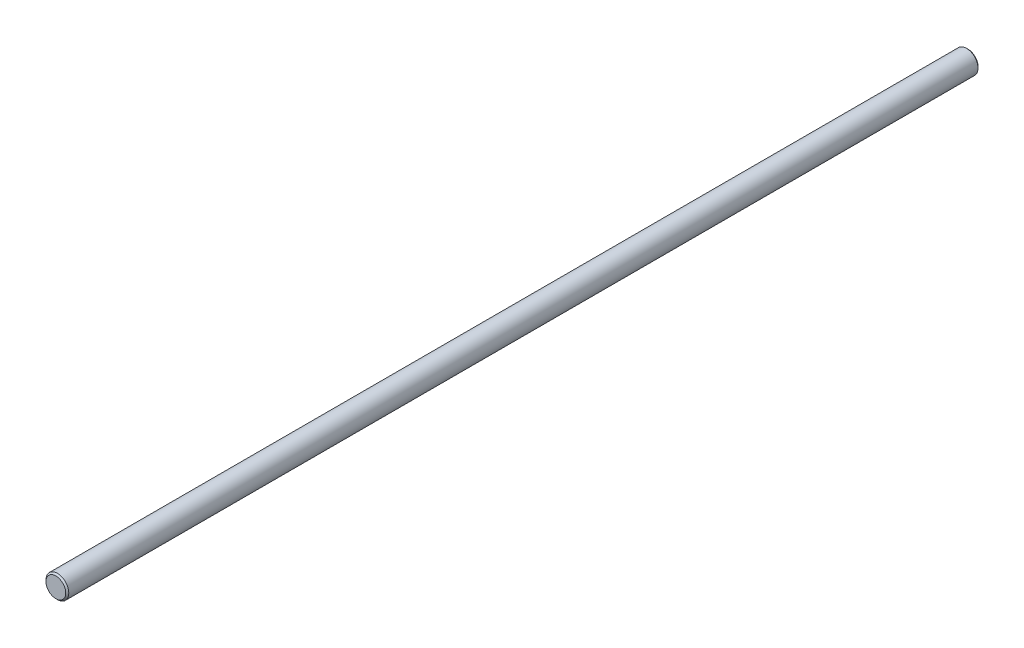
ISO-10303-21;
HEADER;
FILE_DESCRIPTION(('STEP AP214'),'2;1');
FILE_NAME('part.step','',(''),(''),'','','');
FILE_SCHEMA(('AUTOMOTIVE_DESIGN { 1 0 10303 214 1 1 1 1 }'));
ENDSEC;
DATA;
#1=APPLICATION_CONTEXT('core data for automotive mechanical design processes');
#2=APPLICATION_PROTOCOL_DEFINITION('international standard','automotive_design',2000,#1);
#3=PRODUCT_CONTEXT('',#1,'mechanical');
#4=PRODUCT('Part','Part','',(#3));
#5=PRODUCT_RELATED_PRODUCT_CATEGORY('part','',(#4));
#6=PRODUCT_DEFINITION_FORMATION('','',#4);
#7=PRODUCT_DEFINITION_CONTEXT('part definition',#1,'design');
#8=PRODUCT_DEFINITION('design','',#6,#7);
#9=PRODUCT_DEFINITION_SHAPE('','',#8);
#10=(LENGTH_UNIT() NAMED_UNIT(*) SI_UNIT(.MILLI.,.METRE.));
#11=(NAMED_UNIT(*) PLANE_ANGLE_UNIT() SI_UNIT($,.RADIAN.));
#12=(NAMED_UNIT(*) SI_UNIT($,.STERADIAN.) SOLID_ANGLE_UNIT());
#13=UNCERTAINTY_MEASURE_WITH_UNIT(LENGTH_MEASURE(1.E-05),#10,'distance_accuracy_value','');
#14=(GEOMETRIC_REPRESENTATION_CONTEXT(3) GLOBAL_UNCERTAINTY_ASSIGNED_CONTEXT((#13)) GLOBAL_UNIT_ASSIGNED_CONTEXT((#10,
#11,#12)) REPRESENTATION_CONTEXT('',''));
#15=CARTESIAN_POINT('',(0.,0.,0.));
#16=DIRECTION('',(0.,0.,1.));
#17=DIRECTION('',(1.,0.,0.));
#18=AXIS2_PLACEMENT_3D('',#15,#16,#17);
#19=CARTESIAN_POINT('',(0.,0.,120.));
#20=DIRECTION('',(0.,0.,-1.));
#21=DIRECTION('',(-1.,0.,0.));
#22=AXIS2_PLACEMENT_3D('',#19,#20,#21);
#23=CYLINDRICAL_SURFACE('',#22,1.5);
#24=CARTESIAN_POINT('',(0.,0.,0.200000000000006));
#25=DIRECTION('',(0.,0.,1.));
#26=DIRECTION('',(1.,0.,0.));
#27=AXIS2_PLACEMENT_3D('',#24,#25,#26);
#28=CIRCLE('',#27,1.5);
#29=CARTESIAN_POINT('',(1.5,0.,0.200000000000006));
#30=VERTEX_POINT('',#29);
#31=EDGE_CURVE('E34',#30,#30,#28,.T.);
#32=ORIENTED_EDGE('',*,*,#31,.T.);
#33=EDGE_LOOP('',(#32));
#34=FACE_BOUND('',#33,.T.);
#35=CARTESIAN_POINT('',(0.,0.,119.8));
#36=DIRECTION('',(0.,0.,1.));
#37=DIRECTION('',(1.,0.,0.));
#38=AXIS2_PLACEMENT_3D('',#35,#36,#37);
#39=CIRCLE('',#38,1.5);
#40=CARTESIAN_POINT('',(1.5,0.,119.8));
#41=VERTEX_POINT('',#40);
#42=EDGE_CURVE('E38',#41,#41,#39,.F.);
#43=ORIENTED_EDGE('',*,*,#42,.T.);
#44=EDGE_LOOP('',(#43));
#45=FACE_BOUND('',#44,.T.);
#46=ADVANCED_FACE('F24',(#34,#45),#23,.T.);
#47=CARTESIAN_POINT('',(0.,0.,120.));
#48=DIRECTION('',(0.,0.,1.));
#49=DIRECTION('',(1.,0.,0.));
#50=AXIS2_PLACEMENT_3D('',#47,#48,#49);
#51=PLANE('',#50);
#52=CARTESIAN_POINT('',(0.,0.,120.));
#53=DIRECTION('',(0.,0.,1.));
#54=DIRECTION('',(1.,0.,0.));
#55=AXIS2_PLACEMENT_3D('',#52,#53,#54);
#56=CIRCLE('',#55,1.3);
#57=CARTESIAN_POINT('',(1.3,0.,120.));
#58=VERTEX_POINT('',#57);
#59=EDGE_CURVE('E10',#58,#58,#56,.T.);
#60=ORIENTED_EDGE('',*,*,#59,.T.);
#61=EDGE_LOOP('',(#60));
#62=FACE_BOUND('',#61,.T.);
#63=ADVANCED_FACE('F57',(#62),#51,.T.);
#64=CARTESIAN_POINT('',(0.,0.,0.));
#65=DIRECTION('',(0.,0.,1.));
#66=DIRECTION('',(1.,0.,0.));
#67=AXIS2_PLACEMENT_3D('',#64,#65,#66);
#68=PLANE('',#67);
#69=CARTESIAN_POINT('',(0.,0.,0.));
#70=DIRECTION('',(0.,0.,1.));
#71=DIRECTION('',(1.,0.,0.));
#72=AXIS2_PLACEMENT_3D('',#69,#70,#71);
#73=CIRCLE('',#72,1.3);
#74=CARTESIAN_POINT('',(1.3,0.,0.));
#75=VERTEX_POINT('',#74);
#76=EDGE_CURVE('E30',#75,#75,#73,.F.);
#77=ORIENTED_EDGE('',*,*,#76,.T.);
#78=EDGE_LOOP('',(#77));
#79=FACE_BOUND('',#78,.T.);
#80=ADVANCED_FACE('F53',(#79),#68,.F.);
#81=CARTESIAN_POINT('',(0.,0.,0.200000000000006));
#82=DIRECTION('',(0.,0.,1.));
#83=DIRECTION('',(1.,0.,0.));
#84=AXIS2_PLACEMENT_3D('',#81,#82,#83);
#85=CONICAL_SURFACE('',#84,1.5,0.785398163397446);
#86=ORIENTED_EDGE('',*,*,#76,.F.);
#87=EDGE_LOOP('',(#86));
#88=FACE_BOUND('',#87,.T.);
#89=ORIENTED_EDGE('',*,*,#31,.F.);
#90=EDGE_LOOP('',(#89));
#91=FACE_BOUND('',#90,.T.);
#92=ADVANCED_FACE('F48',(#88,#91),#85,.T.);
#93=CARTESIAN_POINT('',(0.,0.,120.));
#94=DIRECTION('',(0.,0.,-1.));
#95=DIRECTION('',(-1.,0.,0.));
#96=AXIS2_PLACEMENT_3D('',#93,#94,#95);
#97=CONICAL_SURFACE('',#96,1.3,0.785398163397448);
#98=ORIENTED_EDGE('',*,*,#42,.F.);
#99=EDGE_LOOP('',(#98));
#100=FACE_BOUND('',#99,.T.);
#101=ORIENTED_EDGE('',*,*,#59,.F.);
#102=EDGE_LOOP('',(#101));
#103=FACE_BOUND('',#102,.T.);
#104=ADVANCED_FACE('F45',(#100,#103),#97,.T.);
#105=CLOSED_SHELL('',(#46,#63,#80,#92,#104));
#106=MANIFOLD_SOLID_BREP('B2',#105);
#107=ADVANCED_BREP_SHAPE_REPRESENTATION('',(#18,#106),#14);
#108=SHAPE_DEFINITION_REPRESENTATION(#9,#107);
ENDSEC;
END-ISO-10303-21;
